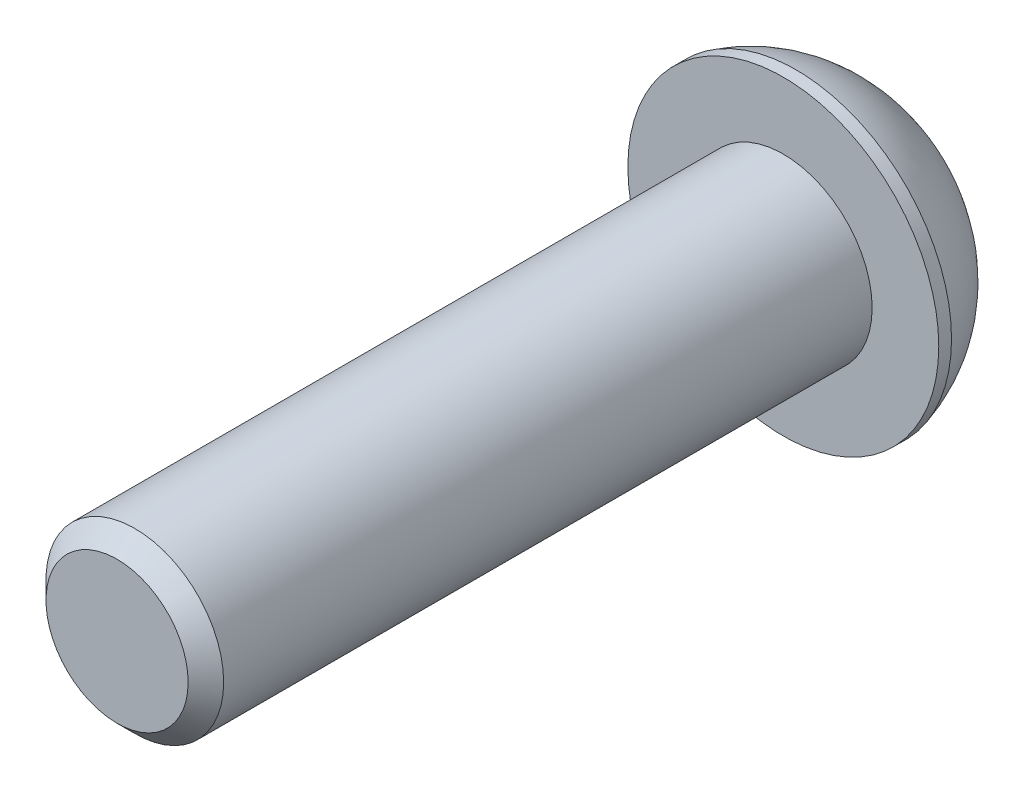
from build123d import *

# Parameters (mm, degrees)
ENLEV_MAT_EXTRU1_DEPTH = 2.6
ESQUISSE3_W            = 4
ESQUISSE3_H            = 30
CHANFREIN1_SIZE        = 0.8


with BuildPart() as part:
    # Esquisse1 → Base-R_volution (revolve)
    with BuildSketch(Plane(origin=(0, 0, 0), x_dir=(1, 0, 0), z_dir=(0, 1, 0)), mode=Mode.PRIVATE) as base_r_volution_sk:
        with BuildLine():
            Line((0, 0), (7, 0))
            Line((7, 0), (7, 0.574933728))
            ThreePointArc((7, 0.574933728), (5.912888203, 2.77937838), (4.064923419, 4.4))
            Line((4.064923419, 4.4), (0, 4.4))
            Line((0, 4.4), (0, 0))
        make_face()
    revolve(base_r_volution_sk.sketch.rotate(Axis((0, 0, 0), (0, 0, -1)), 180), axis=Axis((0, 0, 0), (0, 0, -1)))

    # Esquisse2 → enlev-mat-Extru1 (cut)
    with BuildSketch(Plane.XY.offset(-4.4)):
        Polygon((2.5, -1.443375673), (2.5, 1.443375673), (0, 2.886751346), (-2.5, 1.443375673), (-2.5, -1.443375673), (0, -2.886751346), align=None)
    extrude(amount=ENLEV_MAT_EXTRU1_DEPTH, mode=Mode.SUBTRACT)

    # Esquisse3 → Boss.-R_vol.1 (revolve)
    with BuildSketch(Plane(origin=(0, 0, 0), x_dir=(1, 0, 0), z_dir=(0, 1, 0)), mode=Mode.PRIVATE) as boss_r_vol_1_sk:
        with Locations((2, -15)):
            Rectangle(ESQUISSE3_W, ESQUISSE3_H)
    revolve(boss_r_vol_1_sk.sketch.rotate(Axis((0, 0, 0), (0, 0, 1)), 180), axis=Axis((0, 0, 0), (0, 0, 1)))

    # Chanfrein1
    chanfrein1_edges = [part.edges().sort_by_distance(p)[0] for p in [
        (4, 0, 30),
    ]]
    chamfer(chanfrein1_edges, length=CHANFREIN1_SIZE)


solid = part.part
